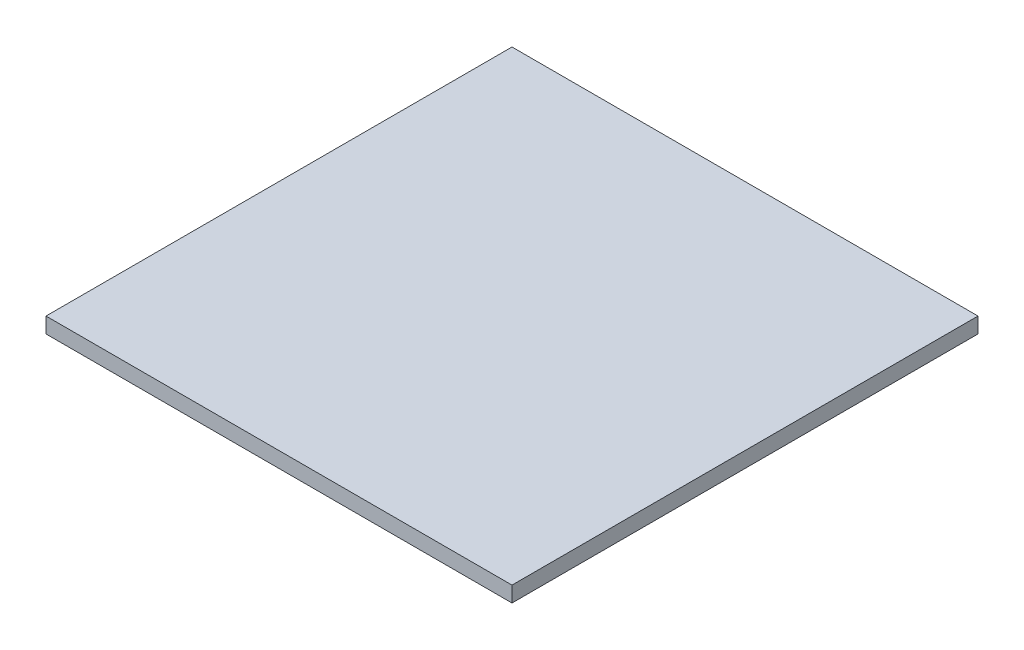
ISO-10303-21;
HEADER;
FILE_DESCRIPTION(('STEP AP214'),'2;1');
FILE_NAME('part.step','',(''),(''),'','','');
FILE_SCHEMA(('AUTOMOTIVE_DESIGN { 1 0 10303 214 1 1 1 1 }'));
ENDSEC;
DATA;
#1=APPLICATION_CONTEXT('core data for automotive mechanical design processes');
#2=APPLICATION_PROTOCOL_DEFINITION('international standard','automotive_design',2000,#1);
#3=PRODUCT_CONTEXT('',#1,'mechanical');
#4=PRODUCT('Part','Part','',(#3));
#5=PRODUCT_RELATED_PRODUCT_CATEGORY('part','',(#4));
#6=PRODUCT_DEFINITION_FORMATION('','',#4);
#7=PRODUCT_DEFINITION_CONTEXT('part definition',#1,'design');
#8=PRODUCT_DEFINITION('design','',#6,#7);
#9=PRODUCT_DEFINITION_SHAPE('','',#8);
#10=(LENGTH_UNIT() NAMED_UNIT(*) SI_UNIT(.MILLI.,.METRE.));
#11=(NAMED_UNIT(*) PLANE_ANGLE_UNIT() SI_UNIT($,.RADIAN.));
#12=(NAMED_UNIT(*) SI_UNIT($,.STERADIAN.) SOLID_ANGLE_UNIT());
#13=UNCERTAINTY_MEASURE_WITH_UNIT(LENGTH_MEASURE(1.E-05),#10,'distance_accuracy_value','');
#14=(GEOMETRIC_REPRESENTATION_CONTEXT(3) GLOBAL_UNCERTAINTY_ASSIGNED_CONTEXT((#13)) GLOBAL_UNIT_ASSIGNED_CONTEXT((#10,
#11,#12)) REPRESENTATION_CONTEXT('',''));
#15=CARTESIAN_POINT('',(0.,0.,0.));
#16=DIRECTION('',(0.,0.,1.));
#17=DIRECTION('',(1.,0.,0.));
#18=AXIS2_PLACEMENT_3D('',#15,#16,#17);
#19=CARTESIAN_POINT('',(-152.4,10.16,-152.4));
#20=DIRECTION('',(1.,0.,0.));
#21=DIRECTION('',(0.,0.,-1.));
#22=AXIS2_PLACEMENT_3D('',#19,#20,#21);
#23=PLANE('',#22);
#24=DIRECTION('',(0.,0.,1.));
#25=VECTOR('',#24,1.);
#26=CARTESIAN_POINT('',(-152.4,0.,-152.4));
#27=LINE('',#26,#25);
#28=CARTESIAN_POINT('',(-152.4,0.,-152.4));
#29=VERTEX_POINT('',#28);
#30=CARTESIAN_POINT('',(-152.4,0.,152.4));
#31=VERTEX_POINT('',#30);
#32=EDGE_CURVE('E107',#29,#31,#27,.T.);
#33=ORIENTED_EDGE('',*,*,#32,.T.);
#34=DIRECTION('',(0.,-1.,0.));
#35=VECTOR('',#34,1.);
#36=CARTESIAN_POINT('',(-152.4,10.16,152.4));
#37=LINE('',#36,#35);
#38=CARTESIAN_POINT('',(-152.4,10.16,152.4));
#39=VERTEX_POINT('',#38);
#40=EDGE_CURVE('E11',#39,#31,#37,.T.);
#41=ORIENTED_EDGE('',*,*,#40,.F.);
#42=DIRECTION('',(0.,0.,1.));
#43=VECTOR('',#42,1.);
#44=CARTESIAN_POINT('',(-152.4,10.16,-152.4));
#45=LINE('',#44,#43);
#46=CARTESIAN_POINT('',(-152.4,10.16,-152.4));
#47=VERTEX_POINT('',#46);
#48=EDGE_CURVE('E91',#47,#39,#45,.T.);
#49=ORIENTED_EDGE('',*,*,#48,.F.);
#50=DIRECTION('',(0.,-1.,0.));
#51=VECTOR('',#50,1.);
#52=CARTESIAN_POINT('',(-152.4,10.16,-152.4));
#53=LINE('',#52,#51);
#54=EDGE_CURVE('E103',#47,#29,#53,.T.);
#55=ORIENTED_EDGE('',*,*,#54,.T.);
#56=EDGE_LOOP('',(#33,#41,#49,#55));
#57=FACE_BOUND('',#56,.T.);
#58=ADVANCED_FACE('F39',(#57),#23,.F.);
#59=CARTESIAN_POINT('',(152.4,10.16,152.4));
#60=DIRECTION('',(0.,0.,-1.));
#61=DIRECTION('',(-1.,0.,0.));
#62=AXIS2_PLACEMENT_3D('',#59,#60,#61);
#63=PLANE('',#62);
#64=DIRECTION('',(1.,0.,0.));
#65=VECTOR('',#64,1.);
#66=CARTESIAN_POINT('',(152.4,0.,152.4));
#67=LINE('',#66,#65);
#68=CARTESIAN_POINT('',(152.4,0.,152.4));
#69=VERTEX_POINT('',#68);
#70=EDGE_CURVE('E96',#31,#69,#67,.T.);
#71=ORIENTED_EDGE('',*,*,#70,.T.);
#72=DIRECTION('',(0.,-1.,0.));
#73=VECTOR('',#72,1.);
#74=CARTESIAN_POINT('',(152.4,10.16,152.4));
#75=LINE('',#74,#73);
#76=CARTESIAN_POINT('',(152.4,10.16,152.4));
#77=VERTEX_POINT('',#76);
#78=EDGE_CURVE('E48',#77,#69,#75,.T.);
#79=ORIENTED_EDGE('',*,*,#78,.F.);
#80=DIRECTION('',(1.,0.,0.));
#81=VECTOR('',#80,1.);
#82=CARTESIAN_POINT('',(152.4,10.16,152.4));
#83=LINE('',#82,#81);
#84=EDGE_CURVE('E86',#39,#77,#83,.T.);
#85=ORIENTED_EDGE('',*,*,#84,.F.);
#86=ORIENTED_EDGE('',*,*,#40,.T.);
#87=EDGE_LOOP('',(#71,#79,#85,#86));
#88=FACE_BOUND('',#87,.T.);
#89=ADVANCED_FACE('F95',(#88),#63,.F.);
#90=CARTESIAN_POINT('',(152.4,10.16,-152.4));
#91=DIRECTION('',(-1.,0.,0.));
#92=DIRECTION('',(0.,0.,1.));
#93=AXIS2_PLACEMENT_3D('',#90,#91,#92);
#94=PLANE('',#93);
#95=DIRECTION('',(0.,0.,-1.));
#96=VECTOR('',#95,1.);
#97=CARTESIAN_POINT('',(152.4,0.,-152.4));
#98=LINE('',#97,#96);
#99=CARTESIAN_POINT('',(152.4,0.,-152.4));
#100=VERTEX_POINT('',#99);
#101=EDGE_CURVE('E73',#69,#100,#98,.T.);
#102=ORIENTED_EDGE('',*,*,#101,.T.);
#103=DIRECTION('',(0.,-1.,0.));
#104=VECTOR('',#103,1.);
#105=CARTESIAN_POINT('',(152.4,10.16,-152.4));
#106=LINE('',#105,#104);
#107=CARTESIAN_POINT('',(152.4,10.16,-152.4));
#108=VERTEX_POINT('',#107);
#109=EDGE_CURVE('E98',#108,#100,#106,.T.);
#110=ORIENTED_EDGE('',*,*,#109,.F.);
#111=DIRECTION('',(0.,0.,-1.));
#112=VECTOR('',#111,1.);
#113=CARTESIAN_POINT('',(152.4,10.16,-152.4));
#114=LINE('',#113,#112);
#115=EDGE_CURVE('E89',#77,#108,#114,.T.);
#116=ORIENTED_EDGE('',*,*,#115,.F.);
#117=ORIENTED_EDGE('',*,*,#78,.T.);
#118=EDGE_LOOP('',(#102,#110,#116,#117));
#119=FACE_BOUND('',#118,.T.);
#120=ADVANCED_FACE('F99',(#119),#94,.F.);
#121=CARTESIAN_POINT('',(152.4,10.16,-152.4));
#122=DIRECTION('',(0.,0.,1.));
#123=DIRECTION('',(1.,0.,0.));
#124=AXIS2_PLACEMENT_3D('',#121,#122,#123);
#125=PLANE('',#124);
#126=DIRECTION('',(-1.,0.,0.));
#127=VECTOR('',#126,1.);
#128=CARTESIAN_POINT('',(152.4,0.,-152.4));
#129=LINE('',#128,#127);
#130=EDGE_CURVE('E79',#100,#29,#129,.T.);
#131=ORIENTED_EDGE('',*,*,#130,.T.);
#132=ORIENTED_EDGE('',*,*,#54,.F.);
#133=DIRECTION('',(-1.,0.,0.));
#134=VECTOR('',#133,1.);
#135=CARTESIAN_POINT('',(152.4,10.16,-152.4));
#136=LINE('',#135,#134);
#137=EDGE_CURVE('E56',#108,#47,#136,.T.);
#138=ORIENTED_EDGE('',*,*,#137,.F.);
#139=ORIENTED_EDGE('',*,*,#109,.T.);
#140=EDGE_LOOP('',(#131,#132,#138,#139));
#141=FACE_BOUND('',#140,.T.);
#142=ADVANCED_FACE('F120',(#141),#125,.F.);
#143=CARTESIAN_POINT('',(0.,10.16,0.));
#144=DIRECTION('',(0.,-1.,0.));
#145=DIRECTION('',(0.,0.,-1.));
#146=AXIS2_PLACEMENT_3D('',#143,#144,#145);
#147=PLANE('',#146);
#148=ORIENTED_EDGE('',*,*,#48,.T.);
#149=ORIENTED_EDGE('',*,*,#84,.T.);
#150=ORIENTED_EDGE('',*,*,#115,.T.);
#151=ORIENTED_EDGE('',*,*,#137,.T.);
#152=EDGE_LOOP('',(#148,#149,#150,#151));
#153=FACE_BOUND('',#152,.T.);
#154=ADVANCED_FACE('F87',(#153),#147,.F.);
#155=CARTESIAN_POINT('',(0.,0.,0.));
#156=DIRECTION('',(0.,-1.,0.));
#157=DIRECTION('',(0.,0.,-1.));
#158=AXIS2_PLACEMENT_3D('',#155,#156,#157);
#159=PLANE('',#158);
#160=ORIENTED_EDGE('',*,*,#32,.F.);
#161=ORIENTED_EDGE('',*,*,#130,.F.);
#162=ORIENTED_EDGE('',*,*,#101,.F.);
#163=ORIENTED_EDGE('',*,*,#70,.F.);
#164=EDGE_LOOP('',(#160,#161,#162,#163));
#165=FACE_BOUND('',#164,.T.);
#166=ADVANCED_FACE('F123',(#165),#159,.T.);
#167=CLOSED_SHELL('',(#58,#89,#120,#142,#154,#166));
#168=MANIFOLD_SOLID_BREP('B2',#167);
#169=ADVANCED_BREP_SHAPE_REPRESENTATION('',(#18,#168),#14);
#170=SHAPE_DEFINITION_REPRESENTATION(#9,#169);
ENDSEC;
END-ISO-10303-21;
